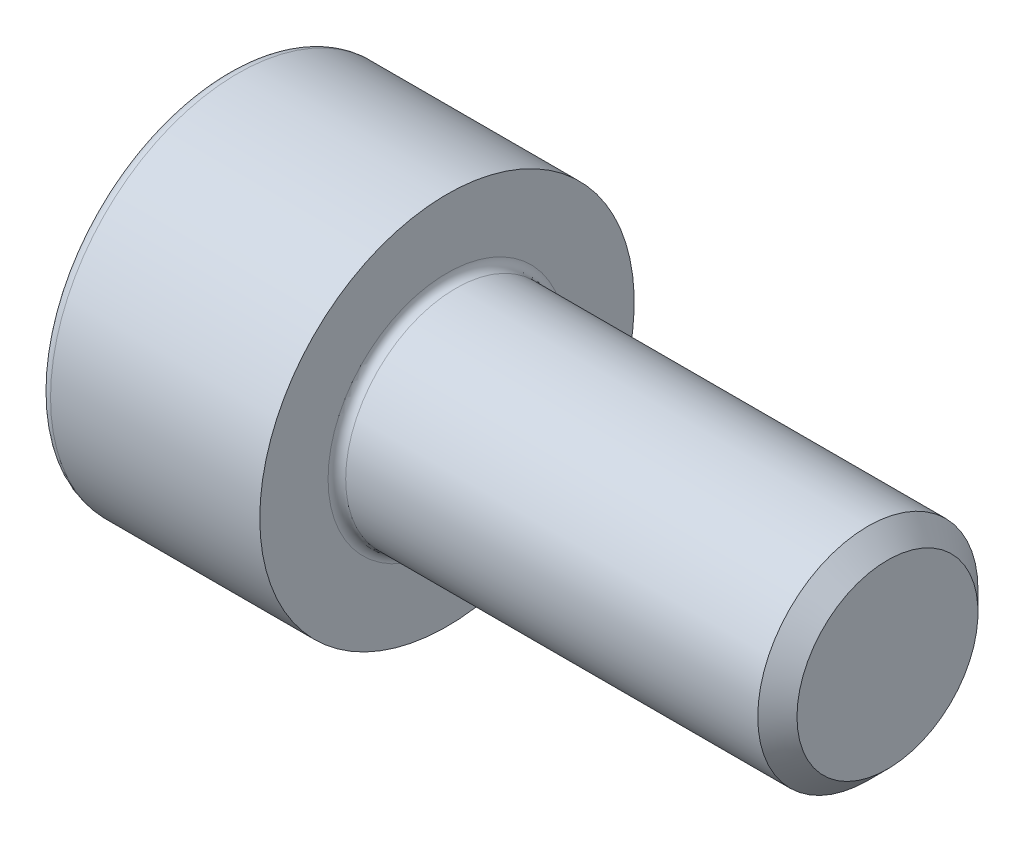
ISO-10303-21;
HEADER;
FILE_DESCRIPTION(('STEP AP214'),'2;1');
FILE_NAME('part.step','',(''),(''),'','','');
FILE_SCHEMA(('AUTOMOTIVE_DESIGN { 1 0 10303 214 1 1 1 1 }'));
ENDSEC;
DATA;
#1=APPLICATION_CONTEXT('core data for automotive mechanical design processes');
#2=APPLICATION_PROTOCOL_DEFINITION('international standard','automotive_design',2000,#1);
#3=PRODUCT_CONTEXT('',#1,'mechanical');
#4=PRODUCT('Part','Part','',(#3));
#5=PRODUCT_RELATED_PRODUCT_CATEGORY('part','',(#4));
#6=PRODUCT_DEFINITION_FORMATION('','',#4);
#7=PRODUCT_DEFINITION_CONTEXT('part definition',#1,'design');
#8=PRODUCT_DEFINITION('design','',#6,#7);
#9=PRODUCT_DEFINITION_SHAPE('','',#8);
#10=(LENGTH_UNIT() NAMED_UNIT(*) SI_UNIT(.MILLI.,.METRE.));
#11=(NAMED_UNIT(*) PLANE_ANGLE_UNIT() SI_UNIT($,.RADIAN.));
#12=(NAMED_UNIT(*) SI_UNIT($,.STERADIAN.) SOLID_ANGLE_UNIT());
#13=UNCERTAINTY_MEASURE_WITH_UNIT(LENGTH_MEASURE(1.E-05),#10,'distance_accuracy_value','');
#14=(GEOMETRIC_REPRESENTATION_CONTEXT(3) GLOBAL_UNCERTAINTY_ASSIGNED_CONTEXT((#13)) GLOBAL_UNIT_ASSIGNED_CONTEXT((#10,
#11,#12)) REPRESENTATION_CONTEXT('',''));
#15=CARTESIAN_POINT('',(0.,0.,0.));
#16=DIRECTION('',(0.,0.,1.));
#17=DIRECTION('',(1.,0.,0.));
#18=AXIS2_PLACEMENT_3D('',#15,#16,#17);
#19=CARTESIAN_POINT('',(0.,0.,0.));
#20=DIRECTION('',(-1.,0.,0.));
#21=DIRECTION('',(0.,0.,1.));
#22=AXIS2_PLACEMENT_3D('',#19,#20,#21);
#23=PLANE('',#22);
#24=DIRECTION('',(0.,-0.499999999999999,0.866025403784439));
#25=VECTOR('',#24,1.);
#26=CARTESIAN_POINT('',(0.,2.35789849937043,0.));
#27=LINE('',#26,#25);
#28=CARTESIAN_POINT('',(0.,2.35789849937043,0.));
#29=VERTEX_POINT('',#28);
#30=CARTESIAN_POINT('',(0.,1.17894924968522,2.042));
#31=VERTEX_POINT('',#30);
#32=EDGE_CURVE('E373',#29,#31,#27,.T.);
#33=ORIENTED_EDGE('',*,*,#32,.T.);
#34=DIRECTION('',(0.,1.,0.));
#35=VECTOR('',#34,1.);
#36=CARTESIAN_POINT('',(0.,-1.17894924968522,2.042));
#37=LINE('',#36,#35);
#38=CARTESIAN_POINT('',(0.,-1.17894924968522,2.042));
#39=VERTEX_POINT('',#38);
#40=EDGE_CURVE('E122',#39,#31,#37,.T.);
#41=ORIENTED_EDGE('',*,*,#40,.F.);
#42=DIRECTION('',(0.,-0.500000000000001,-0.866025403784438));
#43=VECTOR('',#42,1.);
#44=CARTESIAN_POINT('',(0.,-1.17894924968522,2.042));
#45=LINE('',#44,#43);
#46=CARTESIAN_POINT('',(0.,-2.35789849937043,0.));
#47=VERTEX_POINT('',#46);
#48=EDGE_CURVE('E376',#39,#47,#45,.T.);
#49=ORIENTED_EDGE('',*,*,#48,.T.);
#50=DIRECTION('',(0.,0.499999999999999,-0.866025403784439));
#51=VECTOR('',#50,1.);
#52=CARTESIAN_POINT('',(0.,-2.35789849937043,0.));
#53=LINE('',#52,#51);
#54=CARTESIAN_POINT('',(0.,-1.17894924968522,-2.042));
#55=VERTEX_POINT('',#54);
#56=EDGE_CURVE('E379',#47,#55,#53,.T.);
#57=ORIENTED_EDGE('',*,*,#56,.T.);
#58=DIRECTION('',(0.,-1.,0.));
#59=VECTOR('',#58,1.);
#60=CARTESIAN_POINT('',(0.,1.17894924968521,-2.042));
#61=LINE('',#60,#59);
#62=CARTESIAN_POINT('',(0.,1.17894924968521,-2.042));
#63=VERTEX_POINT('',#62);
#64=EDGE_CURVE('E382',#63,#55,#61,.T.);
#65=ORIENTED_EDGE('',*,*,#64,.F.);
#66=DIRECTION('',(0.,-0.500000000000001,-0.866025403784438));
#67=VECTOR('',#66,1.);
#68=CARTESIAN_POINT('',(0.,2.35789849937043,0.));
#69=LINE('',#68,#67);
#70=EDGE_CURVE('E117',#29,#63,#69,.T.);
#71=ORIENTED_EDGE('',*,*,#70,.F.);
#72=EDGE_LOOP('',(#33,#41,#49,#57,#65,#71));
#73=FACE_BOUND('',#72,.T.);
#74=CARTESIAN_POINT('',(0.,0.,0.));
#75=DIRECTION('',(-1.,0.,0.));
#76=DIRECTION('',(0.,0.,1.));
#77=AXIS2_PLACEMENT_3D('',#74,#75,#76);
#78=CIRCLE('',#77,4.);
#79=CARTESIAN_POINT('',(0.,0.,4.));
#80=VERTEX_POINT('',#79);
#81=EDGE_CURVE('E38',#80,#80,#78,.T.);
#82=ORIENTED_EDGE('',*,*,#81,.T.);
#83=EDGE_LOOP('',(#82));
#84=FACE_BOUND('',#83,.T.);
#85=ADVANCED_FACE('F30',(#73,#84),#23,.T.);
#86=CARTESIAN_POINT('',(15.,2.055,0.));
#87=DIRECTION('',(1.,0.,0.));
#88=DIRECTION('',(0.,0.,-1.));
#89=AXIS2_PLACEMENT_3D('',#86,#87,#88);
#90=PLANE('',#89);
#91=CARTESIAN_POINT('',(15.,0.,0.));
#92=DIRECTION('',(-1.,0.,0.));
#93=DIRECTION('',(0.,0.,1.));
#94=AXIS2_PLACEMENT_3D('',#91,#92,#93);
#95=CIRCLE('',#94,2.055);
#96=CARTESIAN_POINT('',(15.,0.,2.055));
#97=VERTEX_POINT('',#96);
#98=EDGE_CURVE('E140',#97,#97,#95,.T.);
#99=ORIENTED_EDGE('',*,*,#98,.F.);
#100=EDGE_LOOP('',(#99));
#101=FACE_BOUND('',#100,.T.);
#102=ADVANCED_FACE('F164',(#101),#90,.T.);
#103=CARTESIAN_POINT('',(15.,0.,0.));
#104=DIRECTION('',(-1.,0.,0.));
#105=DIRECTION('',(0.,0.,1.));
#106=AXIS2_PLACEMENT_3D('',#103,#104,#105);
#107=CONICAL_SURFACE('',#106,2.055,0.785398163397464);
#108=CARTESIAN_POINT('',(14.555,0.,0.));
#109=DIRECTION('',(-1.,0.,0.));
#110=DIRECTION('',(0.,0.,1.));
#111=AXIS2_PLACEMENT_3D('',#108,#109,#110);
#112=CIRCLE('',#111,2.5);
#113=CARTESIAN_POINT('',(14.555,0.,2.5));
#114=VERTEX_POINT('',#113);
#115=EDGE_CURVE('E137',#114,#114,#112,.T.);
#116=ORIENTED_EDGE('',*,*,#115,.F.);
#117=EDGE_LOOP('',(#116));
#118=FACE_BOUND('',#117,.T.);
#119=ORIENTED_EDGE('',*,*,#98,.T.);
#120=EDGE_LOOP('',(#119));
#121=FACE_BOUND('',#120,.T.);
#122=ADVANCED_FACE('F170',(#118,#121),#107,.T.);
#123=CARTESIAN_POINT('',(-31.75,0.,0.));
#124=DIRECTION('',(-1.,0.,0.));
#125=DIRECTION('',(0.,0.,1.));
#126=AXIS2_PLACEMENT_3D('',#123,#124,#125);
#127=CYLINDRICAL_SURFACE('',#126,2.5);
#128=CARTESIAN_POINT('',(5.2,0.,0.));
#129=DIRECTION('',(1.,0.,0.));
#130=DIRECTION('',(0.,0.,-1.));
#131=AXIS2_PLACEMENT_3D('',#128,#129,#130);
#132=CIRCLE('',#131,2.5);
#133=CARTESIAN_POINT('',(5.2,0.,-2.5));
#134=VERTEX_POINT('',#133);
#135=EDGE_CURVE('E146',#134,#134,#132,.T.);
#136=ORIENTED_EDGE('',*,*,#135,.T.);
#137=EDGE_LOOP('',(#136));
#138=FACE_BOUND('',#137,.T.);
#139=ORIENTED_EDGE('',*,*,#115,.T.);
#140=EDGE_LOOP('',(#139));
#141=FACE_BOUND('',#140,.T.);
#142=ADVANCED_FACE('F182',(#138,#141),#127,.T.);
#143=CARTESIAN_POINT('',(5.,4.25,0.));
#144=DIRECTION('',(1.,0.,0.));
#145=DIRECTION('',(0.,0.,-1.));
#146=AXIS2_PLACEMENT_3D('',#143,#144,#145);
#147=PLANE('',#146);
#148=CARTESIAN_POINT('',(5.,0.,0.));
#149=DIRECTION('',(1.,0.,0.));
#150=DIRECTION('',(0.,0.,-1.));
#151=AXIS2_PLACEMENT_3D('',#148,#149,#150);
#152=CIRCLE('',#151,2.7);
#153=CARTESIAN_POINT('',(5.,0.,-2.7));
#154=VERTEX_POINT('',#153);
#155=EDGE_CURVE('E143',#154,#154,#152,.F.);
#156=ORIENTED_EDGE('',*,*,#155,.T.);
#157=EDGE_LOOP('',(#156));
#158=FACE_BOUND('',#157,.T.);
#159=CARTESIAN_POINT('',(5.,0.,0.));
#160=DIRECTION('',(-1.,0.,0.));
#161=DIRECTION('',(0.,0.,1.));
#162=AXIS2_PLACEMENT_3D('',#159,#160,#161);
#163=CIRCLE('',#162,4.25);
#164=CARTESIAN_POINT('',(5.,0.,4.25));
#165=VERTEX_POINT('',#164);
#166=EDGE_CURVE('E133',#165,#165,#163,.T.);
#167=ORIENTED_EDGE('',*,*,#166,.F.);
#168=EDGE_LOOP('',(#167));
#169=FACE_BOUND('',#168,.T.);
#170=ADVANCED_FACE('F178',(#158,#169),#147,.T.);
#171=CARTESIAN_POINT('',(-31.75,0.,0.));
#172=DIRECTION('',(-1.,0.,0.));
#173=DIRECTION('',(0.,0.,1.));
#174=AXIS2_PLACEMENT_3D('',#171,#172,#173);
#175=CYLINDRICAL_SURFACE('',#174,4.25);
#176=CARTESIAN_POINT('',(0.25,0.,0.));
#177=DIRECTION('',(-1.,0.,0.));
#178=DIRECTION('',(0.,0.,1.));
#179=AXIS2_PLACEMENT_3D('',#176,#177,#178);
#180=CIRCLE('',#179,4.25);
#181=CARTESIAN_POINT('',(0.25,0.,4.25));
#182=VERTEX_POINT('',#181);
#183=EDGE_CURVE('E11',#182,#182,#180,.F.);
#184=ORIENTED_EDGE('',*,*,#183,.T.);
#185=EDGE_LOOP('',(#184));
#186=FACE_BOUND('',#185,.T.);
#187=ORIENTED_EDGE('',*,*,#166,.T.);
#188=EDGE_LOOP('',(#187));
#189=FACE_BOUND('',#188,.T.);
#190=ADVANCED_FACE('F160',(#186,#189),#175,.T.);
#191=CARTESIAN_POINT('',(5.2,0.,0.));
#192=DIRECTION('',(1.,0.,0.));
#193=DIRECTION('',(0.,0.,-1.));
#194=AXIS2_PLACEMENT_3D('',#191,#192,#193);
#195=TOROIDAL_SURFACE('',#194,2.7,0.2);
#196=ORIENTED_EDGE('',*,*,#135,.F.);
#197=EDGE_LOOP('',(#196));
#198=FACE_BOUND('',#197,.T.);
#199=ORIENTED_EDGE('',*,*,#155,.F.);
#200=EDGE_LOOP('',(#199));
#201=FACE_BOUND('',#200,.T.);
#202=ADVANCED_FACE('F153',(#198,#201),#195,.F.);
#203=CARTESIAN_POINT('',(0.25,0.,0.));
#204=DIRECTION('',(-1.,0.,0.));
#205=DIRECTION('',(0.,0.,1.));
#206=AXIS2_PLACEMENT_3D('',#203,#204,#205);
#207=TOROIDAL_SURFACE('',#206,4.,0.25);
#208=ORIENTED_EDGE('',*,*,#183,.F.);
#209=EDGE_LOOP('',(#208));
#210=FACE_BOUND('',#209,.T.);
#211=ORIENTED_EDGE('',*,*,#81,.F.);
#212=EDGE_LOOP('',(#211));
#213=FACE_BOUND('',#212,.T.);
#214=ADVANCED_FACE('F32',(#210,#213),#207,.T.);
#215=CARTESIAN_POINT('',(2.5,2.35789849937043,0.));
#216=DIRECTION('',(0.,-0.866025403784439,-0.499999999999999));
#217=DIRECTION('',(0.,0.499999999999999,-0.866025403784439));
#218=AXIS2_PLACEMENT_3D('',#215,#216,#217);
#219=PLANE('',#218);
#220=ORIENTED_EDGE('',*,*,#32,.F.);
#221=DIRECTION('',(-1.,0.,0.));
#222=VECTOR('',#221,1.);
#223=CARTESIAN_POINT('',(2.5,2.35789849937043,0.));
#224=LINE('',#223,#222);
#225=CARTESIAN_POINT('',(2.5,2.35789849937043,0.));
#226=VERTEX_POINT('',#225);
#227=EDGE_CURVE('E372',#226,#29,#224,.T.);
#228=ORIENTED_EDGE('',*,*,#227,.F.);
#229=DIRECTION('',(0.,-0.499999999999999,0.866025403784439));
#230=VECTOR('',#229,1.);
#231=CARTESIAN_POINT('',(2.5,2.35789849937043,0.));
#232=LINE('',#231,#230);
#233=CARTESIAN_POINT('',(2.5,1.76842387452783,1.021));
#234=VERTEX_POINT('',#233);
#235=EDGE_CURVE('E45',#226,#234,#232,.T.);
#236=ORIENTED_EDGE('',*,*,#235,.T.);
#237=CARTESIAN_POINT('',(2.5,1.17894924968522,2.042));
#238=VERTEX_POINT('',#237);
#239=EDGE_CURVE('E103',#234,#238,#232,.T.);
#240=ORIENTED_EDGE('',*,*,#239,.T.);
#241=DIRECTION('',(-1.,0.,0.));
#242=VECTOR('',#241,1.);
#243=CARTESIAN_POINT('',(2.5,1.17894924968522,2.042));
#244=LINE('',#243,#242);
#245=EDGE_CURVE('E115',#238,#31,#244,.T.);
#246=ORIENTED_EDGE('',*,*,#245,.T.);
#247=EDGE_LOOP('',(#220,#228,#236,#240,#246));
#248=FACE_BOUND('',#247,.T.);
#249=ADVANCED_FACE('F114',(#248),#219,.T.);
#250=CARTESIAN_POINT('',(2.5,-1.17894924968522,2.042));
#251=DIRECTION('',(0.,0.,1.));
#252=DIRECTION('',(0.,-1.,0.));
#253=AXIS2_PLACEMENT_3D('',#250,#251,#252);
#254=PLANE('',#253);
#255=ORIENTED_EDGE('',*,*,#40,.T.);
#256=ORIENTED_EDGE('',*,*,#245,.F.);
#257=DIRECTION('',(0.,1.,0.));
#258=VECTOR('',#257,1.);
#259=CARTESIAN_POINT('',(2.5,-1.17894924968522,2.042));
#260=LINE('',#259,#258);
#261=CARTESIAN_POINT('',(2.5,0.,2.042));
#262=VERTEX_POINT('',#261);
#263=EDGE_CURVE('E101',#262,#238,#260,.T.);
#264=ORIENTED_EDGE('',*,*,#263,.F.);
#265=CARTESIAN_POINT('',(2.5,-1.17894924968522,2.042));
#266=VERTEX_POINT('',#265);
#267=EDGE_CURVE('E111',#266,#262,#260,.T.);
#268=ORIENTED_EDGE('',*,*,#267,.F.);
#269=DIRECTION('',(-1.,0.,0.));
#270=VECTOR('',#269,1.);
#271=CARTESIAN_POINT('',(2.5,-1.17894924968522,2.042));
#272=LINE('',#271,#270);
#273=EDGE_CURVE('E124',#266,#39,#272,.T.);
#274=ORIENTED_EDGE('',*,*,#273,.T.);
#275=EDGE_LOOP('',(#255,#256,#264,#268,#274));
#276=FACE_BOUND('',#275,.T.);
#277=ADVANCED_FACE('F119',(#276),#254,.F.);
#278=CARTESIAN_POINT('',(2.5,-1.17894924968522,2.042));
#279=DIRECTION('',(0.,0.866025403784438,-0.500000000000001));
#280=DIRECTION('',(0.,0.500000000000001,0.866025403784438));
#281=AXIS2_PLACEMENT_3D('',#278,#279,#280);
#282=PLANE('',#281);
#283=ORIENTED_EDGE('',*,*,#48,.F.);
#284=ORIENTED_EDGE('',*,*,#273,.F.);
#285=DIRECTION('',(0.,-0.500000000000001,-0.866025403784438));
#286=VECTOR('',#285,1.);
#287=CARTESIAN_POINT('',(2.5,-1.17894924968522,2.042));
#288=LINE('',#287,#286);
#289=CARTESIAN_POINT('',(2.5,-1.76842387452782,1.021));
#290=VERTEX_POINT('',#289);
#291=EDGE_CURVE('E353',#266,#290,#288,.T.);
#292=ORIENTED_EDGE('',*,*,#291,.T.);
#293=CARTESIAN_POINT('',(2.5,-2.35789849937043,0.));
#294=VERTEX_POINT('',#293);
#295=EDGE_CURVE('E355',#290,#294,#288,.T.);
#296=ORIENTED_EDGE('',*,*,#295,.T.);
#297=DIRECTION('',(-1.,0.,0.));
#298=VECTOR('',#297,1.);
#299=CARTESIAN_POINT('',(2.5,-2.35789849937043,0.));
#300=LINE('',#299,#298);
#301=EDGE_CURVE('E129',#294,#47,#300,.T.);
#302=ORIENTED_EDGE('',*,*,#301,.T.);
#303=EDGE_LOOP('',(#283,#284,#292,#296,#302));
#304=FACE_BOUND('',#303,.T.);
#305=ADVANCED_FACE('F245',(#304),#282,.T.);
#306=CARTESIAN_POINT('',(2.5,-2.35789849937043,0.));
#307=DIRECTION('',(0.,0.866025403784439,0.499999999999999));
#308=DIRECTION('',(0.,-0.499999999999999,0.86602540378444));
#309=AXIS2_PLACEMENT_3D('',#306,#307,#308);
#310=PLANE('',#309);
#311=ORIENTED_EDGE('',*,*,#56,.F.);
#312=ORIENTED_EDGE('',*,*,#301,.F.);
#313=DIRECTION('',(0.,0.499999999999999,-0.866025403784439));
#314=VECTOR('',#313,1.);
#315=CARTESIAN_POINT('',(2.5,-2.35789849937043,0.));
#316=LINE('',#315,#314);
#317=CARTESIAN_POINT('',(2.5,-1.76842387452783,-1.021));
#318=VERTEX_POINT('',#317);
#319=EDGE_CURVE('E358',#294,#318,#316,.T.);
#320=ORIENTED_EDGE('',*,*,#319,.T.);
#321=CARTESIAN_POINT('',(2.5,-1.17894924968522,-2.042));
#322=VERTEX_POINT('',#321);
#323=EDGE_CURVE('E362',#318,#322,#316,.T.);
#324=ORIENTED_EDGE('',*,*,#323,.T.);
#325=DIRECTION('',(-1.,0.,0.));
#326=VECTOR('',#325,1.);
#327=CARTESIAN_POINT('',(2.5,-1.17894924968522,-2.042));
#328=LINE('',#327,#326);
#329=EDGE_CURVE('E391',#322,#55,#328,.T.);
#330=ORIENTED_EDGE('',*,*,#329,.T.);
#331=EDGE_LOOP('',(#311,#312,#320,#324,#330));
#332=FACE_BOUND('',#331,.T.);
#333=ADVANCED_FACE('F253',(#332),#310,.T.);
#334=CARTESIAN_POINT('',(2.5,1.17894924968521,-2.042));
#335=DIRECTION('',(0.,0.,-1.));
#336=DIRECTION('',(0.,1.,0.));
#337=AXIS2_PLACEMENT_3D('',#334,#335,#336);
#338=PLANE('',#337);
#339=ORIENTED_EDGE('',*,*,#64,.T.);
#340=ORIENTED_EDGE('',*,*,#329,.F.);
#341=DIRECTION('',(0.,-1.,0.));
#342=VECTOR('',#341,1.);
#343=CARTESIAN_POINT('',(2.5,1.17894924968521,-2.042));
#344=LINE('',#343,#342);
#345=CARTESIAN_POINT('',(2.5,0.,-2.042));
#346=VERTEX_POINT('',#345);
#347=EDGE_CURVE('E366',#346,#322,#344,.T.);
#348=ORIENTED_EDGE('',*,*,#347,.F.);
#349=CARTESIAN_POINT('',(2.5,1.17894924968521,-2.042));
#350=VERTEX_POINT('',#349);
#351=EDGE_CURVE('E367',#350,#346,#344,.T.);
#352=ORIENTED_EDGE('',*,*,#351,.F.);
#353=DIRECTION('',(-1.,0.,0.));
#354=VECTOR('',#353,1.);
#355=CARTESIAN_POINT('',(2.5,1.17894924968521,-2.042));
#356=LINE('',#355,#354);
#357=EDGE_CURVE('E388',#350,#63,#356,.T.);
#358=ORIENTED_EDGE('',*,*,#357,.T.);
#359=EDGE_LOOP('',(#339,#340,#348,#352,#358));
#360=FACE_BOUND('',#359,.T.);
#361=ADVANCED_FACE('F262',(#360),#338,.F.);
#362=CARTESIAN_POINT('',(2.5,2.35789849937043,0.));
#363=DIRECTION('',(0.,0.866025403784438,-0.500000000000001));
#364=DIRECTION('',(0.,0.500000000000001,0.866025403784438));
#365=AXIS2_PLACEMENT_3D('',#362,#363,#364);
#366=PLANE('',#365);
#367=ORIENTED_EDGE('',*,*,#70,.T.);
#368=ORIENTED_EDGE('',*,*,#357,.F.);
#369=DIRECTION('',(0.,-0.500000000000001,-0.866025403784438));
#370=VECTOR('',#369,1.);
#371=CARTESIAN_POINT('',(2.5,2.35789849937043,0.));
#372=LINE('',#371,#370);
#373=CARTESIAN_POINT('',(2.5,1.76842387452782,-1.021));
#374=VERTEX_POINT('',#373);
#375=EDGE_CURVE('E370',#374,#350,#372,.T.);
#376=ORIENTED_EDGE('',*,*,#375,.F.);
#377=EDGE_CURVE('E344',#226,#374,#372,.T.);
#378=ORIENTED_EDGE('',*,*,#377,.F.);
#379=ORIENTED_EDGE('',*,*,#227,.T.);
#380=EDGE_LOOP('',(#367,#368,#376,#378,#379));
#381=FACE_BOUND('',#380,.T.);
#382=ADVANCED_FACE('F271',(#381),#366,.F.);
#383=CARTESIAN_POINT('',(2.5,1.17894924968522,2.042));
#384=DIRECTION('',(-1.,0.,0.));
#385=DIRECTION('',(0.,0.,1.));
#386=AXIS2_PLACEMENT_3D('',#383,#384,#385);
#387=PLANE('',#386);
#388=CARTESIAN_POINT('',(2.5,0.,0.));
#389=DIRECTION('',(-1.,0.,0.));
#390=DIRECTION('',(0.,0.,1.));
#391=AXIS2_PLACEMENT_3D('',#388,#389,#390);
#392=CIRCLE('',#391,2.042);
#393=EDGE_CURVE('E123',#290,#262,#392,.T.);
#394=ORIENTED_EDGE('',*,*,#393,.F.);
#395=ORIENTED_EDGE('',*,*,#291,.F.);
#396=ORIENTED_EDGE('',*,*,#267,.T.);
#397=EDGE_LOOP('',(#394,#395,#396));
#398=FACE_BOUND('',#397,.T.);
#399=ADVANCED_FACE('F280',(#398),#387,.T.);
#400=EDGE_CURVE('E127',#318,#290,#392,.T.);
#401=ORIENTED_EDGE('',*,*,#400,.F.);
#402=ORIENTED_EDGE('',*,*,#319,.F.);
#403=ORIENTED_EDGE('',*,*,#295,.F.);
#404=EDGE_LOOP('',(#401,#402,#403));
#405=FACE_BOUND('',#404,.T.);
#406=ADVANCED_FACE('F289',(#405),#387,.T.);
#407=EDGE_CURVE('E397',#346,#318,#392,.T.);
#408=ORIENTED_EDGE('',*,*,#407,.F.);
#409=ORIENTED_EDGE('',*,*,#347,.T.);
#410=ORIENTED_EDGE('',*,*,#323,.F.);
#411=EDGE_LOOP('',(#408,#409,#410));
#412=FACE_BOUND('',#411,.T.);
#413=ADVANCED_FACE('F298',(#412),#387,.T.);
#414=EDGE_CURVE('E347',#374,#346,#392,.T.);
#415=ORIENTED_EDGE('',*,*,#414,.F.);
#416=ORIENTED_EDGE('',*,*,#375,.T.);
#417=ORIENTED_EDGE('',*,*,#351,.T.);
#418=EDGE_LOOP('',(#415,#416,#417));
#419=FACE_BOUND('',#418,.T.);
#420=ADVANCED_FACE('F306',(#419),#387,.T.);
#421=EDGE_CURVE('E134',#234,#374,#392,.T.);
#422=ORIENTED_EDGE('',*,*,#421,.F.);
#423=ORIENTED_EDGE('',*,*,#235,.F.);
#424=ORIENTED_EDGE('',*,*,#377,.T.);
#425=EDGE_LOOP('',(#422,#423,#424));
#426=FACE_BOUND('',#425,.T.);
#427=ADVANCED_FACE('F314',(#426),#387,.T.);
#428=EDGE_CURVE('E106',#262,#234,#392,.T.);
#429=ORIENTED_EDGE('',*,*,#428,.F.);
#430=ORIENTED_EDGE('',*,*,#263,.T.);
#431=ORIENTED_EDGE('',*,*,#239,.F.);
#432=EDGE_LOOP('',(#429,#430,#431));
#433=FACE_BOUND('',#432,.T.);
#434=ADVANCED_FACE('F102',(#433),#387,.T.);
#435=CARTESIAN_POINT('',(2.5,0.,0.));
#436=DIRECTION('',(-1.,0.,0.));
#437=DIRECTION('',(0.,0.,1.));
#438=AXIS2_PLACEMENT_3D('',#435,#436,#437);
#439=CONICAL_SURFACE('',#438,2.042,1.04719755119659);
#440=CARTESIAN_POINT('',(3.67894924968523,0.,0.));
#441=VERTEX_POINT('',#440);
#442=VERTEX_LOOP('',#441);
#443=FACE_BOUND('',#442,.T.);
#444=ORIENTED_EDGE('',*,*,#428,.T.);
#445=ORIENTED_EDGE('',*,*,#421,.T.);
#446=ORIENTED_EDGE('',*,*,#414,.T.);
#447=ORIENTED_EDGE('',*,*,#407,.T.);
#448=ORIENTED_EDGE('',*,*,#400,.T.);
#449=ORIENTED_EDGE('',*,*,#393,.T.);
#450=EDGE_LOOP('',(#444,#445,#446,#447,#448,#449));
#451=FACE_BOUND('',#450,.T.);
#452=ADVANCED_FACE('F175',(#443,#451),#439,.F.);
#453=CLOSED_SHELL('',(#85,#102,#122,#142,#170,#190,#202,#214,#249,#277,#305,#333,#361,#382,#399,
#406,#413,#420,#427,#434,#452));
#454=MANIFOLD_SOLID_BREP('B2',#453);
#455=ADVANCED_BREP_SHAPE_REPRESENTATION('',(#18,#454),#14);
#456=SHAPE_DEFINITION_REPRESENTATION(#9,#455);
ENDSEC;
END-ISO-10303-21;
